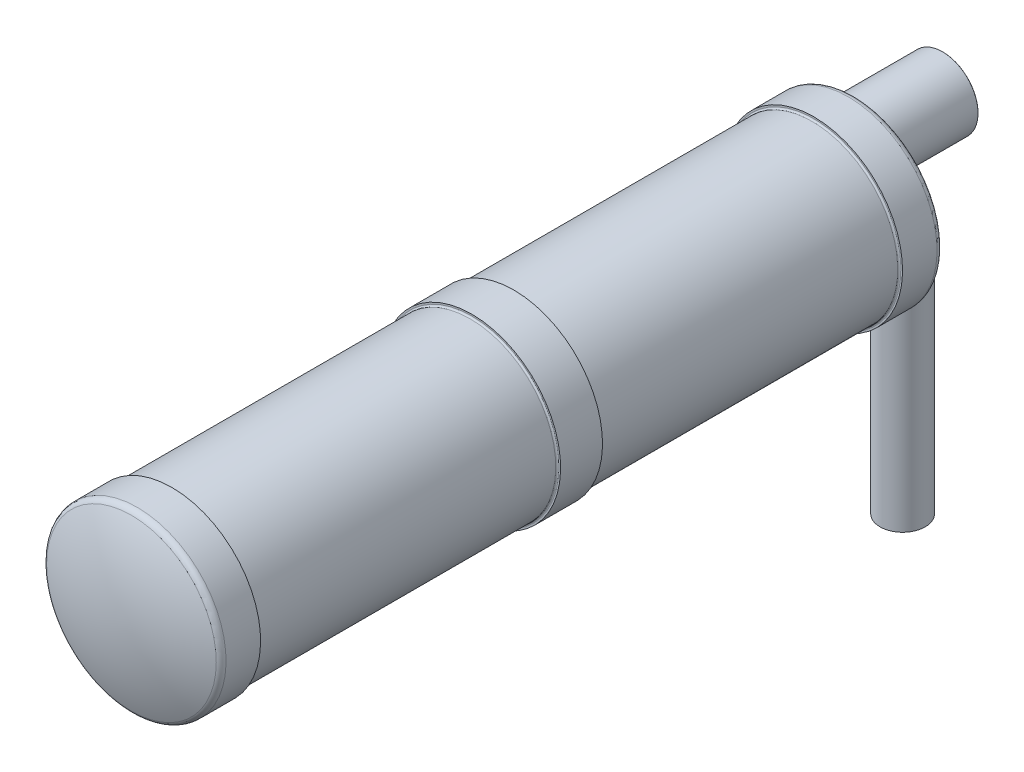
from build123d import *

# Parameters (mm, degrees)
SKETCH1_W          = 6.5
SKETCH1_H          = 1
SKETCH6_R          = 10.470128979
CUT_EXTRUDE3_DEPTH = 48
FILLET2_R          = 0.5
SKETCH9_R          = 6.9
CUT_EXTRUDE4_DEPTH = 67
SKETCH8_R          = 7
SKETCH8_R_2        = 6
FILLET3_R          = 0.5
FILLET4_R          = 0.5


with BuildPart() as part:
    # Sketch1 → Revolve1 (revolve)
    with BuildSketch(Plane(origin=(0, 0, 0), x_dir=(0, 0, -1), z_dir=(1, 0, 0))):
        with BuildLine():
            Line((-4.368798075, 23.61730261), (-5.440871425, 23.61730261))
            ThreePointArc((-5.440871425, 23.61730261), (-2.119861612, 12.01559738), (-1, 0))
            Line((-1, 0), (0, 0))
            ThreePointArc((0, 0), (-1.101386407, 12.008990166), (-4.368798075, 23.61730261))
        make_face()
        with BuildLine():
            Line((-4.916410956, 25), (-5.998264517, 25))
            ThreePointArc((-5.998264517, 25), (-5.715604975, 24.310248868), (-5.440871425, 23.61730261))
            Line((-5.440871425, 23.61730261), (-4.368798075, 23.61730261))
            ThreePointArc((-4.368798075, 23.61730261), (-4.638711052, 24.310193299), (-4.916410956, 25))
        make_face()
        with BuildLine():
            Line((-13.028553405, 26.5), (-7.297608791, 26.5))
            ThreePointArc((-7.297608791, 26.5), (-6.749114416, 26.336154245), (-6.380356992, 25.898307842))
            ThreePointArc((-6.380356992, 25.898307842), (-6.187624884, 25.449871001), (-5.998264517, 25))
            Line((-5.998264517, 25), (-4.916410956, 25))
            ThreePointArc((-4.916410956, 25), (-5.186303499, 25.649764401), (-5.463105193, 26.296615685))
            ThreePointArc((-5.463105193, 26.296615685), (-6.200620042, 27.17230849), (-7.297608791, 27.5))
            Line((-7.297608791, 27.5), (-18, 27.5))
            Line((-18, 27.5), (-18, 26.5))
            Line((-18, 26.5), (-13.028553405, 26.5))
        make_face()
        Polygon((-13.028553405, 25.105194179), (-13.028553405, 26.5), (-18, 26.5), (-111, 26.5), (-116, 26.5), (-116, 25.105194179), align=None)
        with Locations((-114.25, 27)):
            Rectangle(SKETCH1_W, SKETCH1_H)
    revolve1 = revolve(axis=Axis((0, 0, 0), (0, 0, 1)))

    # Sketch6 → Cut-Extrude3 (cut)
    with BuildSketch(Plane.XY):
        with Locations(Location((0, 13.999315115, 0), (0, 0, 223.333490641))):
            Circle(SKETCH6_R)
    extrude(amount=CUT_EXTRUDE3_DEPTH, mode=Mode.SUBTRACT)

    # Sketch1_4 → Revolve2 (revolve)
    with BuildSketch(Plane(origin=(0, 0, 0), x_dir=(0, 0, -1), z_dir=(1, 0, 0))):
        Polygon((-60, 23.61730261), (21.11730261, 23.61730261), (22, 24.5), (22, 24.9), (21.9, 25), (-60, 25), align=None)
    revolve(axis=Axis((0, 14, -5.476141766), (0, 0, 1)))

    # Fillet2
    fillet2_edges = [part.edges().sort_by_distance(p)[0] for p in [
        (10.999998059, 14.00653774, 2.44751049),
    ]]
    fillet(fillet2_edges, radius=FILLET2_R)

    # Mirror1: Revolve1 across plane
    add(revolve1.mirror(Plane.XY.offset(117.5)))

    # Sketch9 → Cut-Extrude4 (cut)
    with BuildSketch(Plane.XY.offset(58.1233355)):
        with Locations(Location((0, -17, 0), (0, 0, 270.000000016))):
            Circle(SKETCH9_R)
    extrude(amount=-CUT_EXTRUDE4_DEPTH, mode=Mode.SUBTRACT)

    # Sweep-Thin2: sweep along a path in Sketch7
    with BuildLine(Plane(origin=(0, 0, 0), x_dir=(0, 0, -1), z_dir=(1, 0, 0))) as sweep_thin2_path:
        Line((-58.1233355, -17), (0, -17))
        ThreePointArc((0, -17), (6.738483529, -19.791187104), (9.529616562, -26.52969303))
        Line((9.529616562, -26.52969303), (9.529616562, -92.877833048))
    # Sketch8 → Sweep-Thin2 (sweep)
    with BuildSketch(Plane.XY.offset(58.1233355)):
        with Locations((0, -17)):
            Circle(SKETCH8_R)
        with Locations((0, -17)):
            Circle(SKETCH8_R_2, mode=Mode.SUBTRACT)
    sweep(path=sweep_thin2_path.line)

    # Fillet3
    fillet3_edges = [part.edges().sort_by_distance(p)[0] for p in [
        (-6.999993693, -17.009402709, 2.613966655),
    ]]
    fillet(fillet3_edges, radius=FILLET3_R)

    # Fillet4
    fillet4_edges = [part.edges().sort_by_distance(p)[0] for p in [
        (0, -26.5, 111),
        (0, -26.5, 18),
        (0, -26.5, 217),
        (0, -26.5, 124),
    ]]
    fillet(fillet4_edges, radius=FILLET4_R)


solid = part.part
